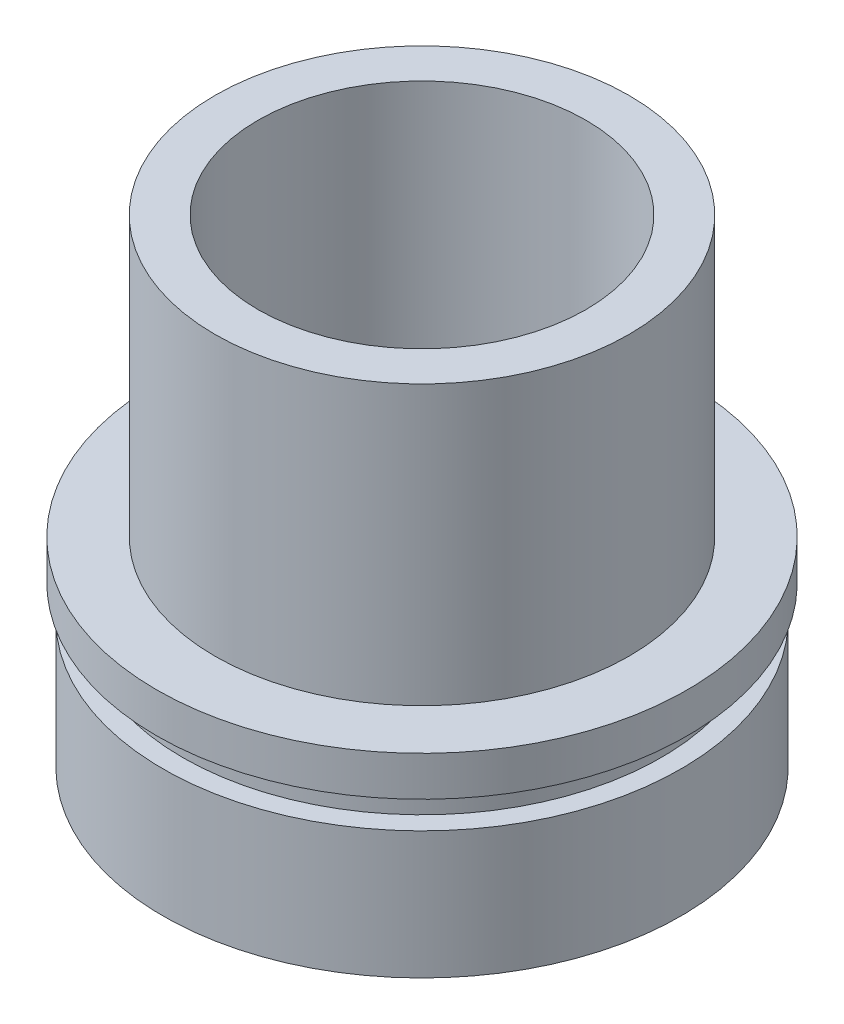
ISO-10303-21;
HEADER;
FILE_DESCRIPTION(('STEP AP214'),'2;1');
FILE_NAME('part.step','',(''),(''),'','','');
FILE_SCHEMA(('AUTOMOTIVE_DESIGN { 1 0 10303 214 1 1 1 1 }'));
ENDSEC;
DATA;
#1=APPLICATION_CONTEXT('core data for automotive mechanical design processes');
#2=APPLICATION_PROTOCOL_DEFINITION('international standard','automotive_design',2000,#1);
#3=PRODUCT_CONTEXT('',#1,'mechanical');
#4=PRODUCT('Part','Part','',(#3));
#5=PRODUCT_RELATED_PRODUCT_CATEGORY('part','',(#4));
#6=PRODUCT_DEFINITION_FORMATION('','',#4);
#7=PRODUCT_DEFINITION_CONTEXT('part definition',#1,'design');
#8=PRODUCT_DEFINITION('design','',#6,#7);
#9=PRODUCT_DEFINITION_SHAPE('','',#8);
#10=(LENGTH_UNIT() NAMED_UNIT(*) SI_UNIT(.MILLI.,.METRE.));
#11=(NAMED_UNIT(*) PLANE_ANGLE_UNIT() SI_UNIT($,.RADIAN.));
#12=(NAMED_UNIT(*) SI_UNIT($,.STERADIAN.) SOLID_ANGLE_UNIT());
#13=UNCERTAINTY_MEASURE_WITH_UNIT(LENGTH_MEASURE(1.E-05),#10,'distance_accuracy_value','');
#14=(GEOMETRIC_REPRESENTATION_CONTEXT(3) GLOBAL_UNCERTAINTY_ASSIGNED_CONTEXT((#13)) GLOBAL_UNIT_ASSIGNED_CONTEXT((#10,
#11,#12)) REPRESENTATION_CONTEXT('',''));
#15=CARTESIAN_POINT('',(0.,0.,0.));
#16=DIRECTION('',(0.,0.,1.));
#17=DIRECTION('',(1.,0.,0.));
#18=AXIS2_PLACEMENT_3D('',#15,#16,#17);
#19=CARTESIAN_POINT('',(0.,0.,0.));
#20=DIRECTION('',(0.,-1.,0.));
#21=DIRECTION('',(0.,0.,-1.));
#22=AXIS2_PLACEMENT_3D('',#19,#20,#21);
#23=CYLINDRICAL_SURFACE('',#22,10.3251);
#24=CARTESIAN_POINT('',(0.,5.08,0.));
#25=DIRECTION('',(0.,-1.,0.));
#26=DIRECTION('',(0.,0.,-1.));
#27=AXIS2_PLACEMENT_3D('',#24,#25,#26);
#28=CIRCLE('',#27,10.3251);
#29=CARTESIAN_POINT('',(0.,5.08,-10.3251));
#30=VERTEX_POINT('',#29);
#31=EDGE_CURVE('E37',#30,#30,#28,.T.);
#32=ORIENTED_EDGE('',*,*,#31,.T.);
#33=EDGE_LOOP('',(#32));
#34=FACE_BOUND('',#33,.T.);
#35=CARTESIAN_POINT('',(0.,0.,0.));
#36=DIRECTION('',(0.,-1.,0.));
#37=DIRECTION('',(0.,0.,-1.));
#38=AXIS2_PLACEMENT_3D('',#35,#36,#37);
#39=CIRCLE('',#38,10.3251);
#40=CARTESIAN_POINT('',(0.,0.,-10.3251));
#41=VERTEX_POINT('',#40);
#42=EDGE_CURVE('E10',#41,#41,#39,.T.);
#43=ORIENTED_EDGE('',*,*,#42,.F.);
#44=EDGE_LOOP('',(#43));
#45=FACE_BOUND('',#44,.T.);
#46=ADVANCED_FACE('F34',(#34,#45),#23,.T.);
#47=CARTESIAN_POINT('',(-6.5405,0.,0.));
#48=DIRECTION('',(0.,1.,0.));
#49=DIRECTION('',(0.,0.,1.));
#50=AXIS2_PLACEMENT_3D('',#47,#48,#49);
#51=PLANE('',#50);
#52=CARTESIAN_POINT('',(0.,0.,0.));
#53=DIRECTION('',(0.,-1.,0.));
#54=DIRECTION('',(0.,0.,-1.));
#55=AXIS2_PLACEMENT_3D('',#52,#53,#54);
#56=CIRCLE('',#55,6.5405);
#57=CARTESIAN_POINT('',(0.,0.,-6.5405));
#58=VERTEX_POINT('',#57);
#59=EDGE_CURVE('E41',#58,#58,#56,.T.);
#60=ORIENTED_EDGE('',*,*,#59,.F.);
#61=EDGE_LOOP('',(#60));
#62=FACE_BOUND('',#61,.T.);
#63=ORIENTED_EDGE('',*,*,#42,.T.);
#64=EDGE_LOOP('',(#63));
#65=FACE_BOUND('',#64,.T.);
#66=ADVANCED_FACE('F86',(#62,#65),#51,.F.);
#67=CARTESIAN_POINT('',(0.,0.,0.));
#68=DIRECTION('',(0.,-1.,0.));
#69=DIRECTION('',(0.,0.,-1.));
#70=AXIS2_PLACEMENT_3D('',#67,#68,#69);
#71=CYLINDRICAL_SURFACE('',#70,6.5405);
#72=CARTESIAN_POINT('',(0.,19.05,0.));
#73=DIRECTION('',(0.,-1.,0.));
#74=DIRECTION('',(0.,0.,-1.));
#75=AXIS2_PLACEMENT_3D('',#72,#73,#74);
#76=CIRCLE('',#75,6.5405);
#77=CARTESIAN_POINT('',(0.,19.05,-6.5405));
#78=VERTEX_POINT('',#77);
#79=EDGE_CURVE('E45',#78,#78,#76,.T.);
#80=ORIENTED_EDGE('',*,*,#79,.F.);
#81=EDGE_LOOP('',(#80));
#82=FACE_BOUND('',#81,.T.);
#83=ORIENTED_EDGE('',*,*,#59,.T.);
#84=EDGE_LOOP('',(#83));
#85=FACE_BOUND('',#84,.T.);
#86=ADVANCED_FACE('F90',(#82,#85),#71,.F.);
#87=CARTESIAN_POINT('',(-6.5405,19.05,0.));
#88=DIRECTION('',(0.,-1.,0.));
#89=DIRECTION('',(0.,0.,-1.));
#90=AXIS2_PLACEMENT_3D('',#87,#88,#89);
#91=PLANE('',#90);
#92=CARTESIAN_POINT('',(0.,19.05,0.));
#93=DIRECTION('',(0.,-1.,0.));
#94=DIRECTION('',(0.,0.,-1.));
#95=AXIS2_PLACEMENT_3D('',#92,#93,#94);
#96=CIRCLE('',#95,8.255);
#97=CARTESIAN_POINT('',(0.,19.05,-8.255));
#98=VERTEX_POINT('',#97);
#99=EDGE_CURVE('E50',#98,#98,#96,.T.);
#100=ORIENTED_EDGE('',*,*,#99,.F.);
#101=EDGE_LOOP('',(#100));
#102=FACE_BOUND('',#101,.T.);
#103=ORIENTED_EDGE('',*,*,#79,.T.);
#104=EDGE_LOOP('',(#103));
#105=FACE_BOUND('',#104,.T.);
#106=ADVANCED_FACE('F95',(#102,#105),#91,.F.);
#107=CARTESIAN_POINT('',(0.,0.,0.));
#108=DIRECTION('',(0.,-1.,0.));
#109=DIRECTION('',(0.,0.,-1.));
#110=AXIS2_PLACEMENT_3D('',#107,#108,#109);
#111=CYLINDRICAL_SURFACE('',#110,8.255);
#112=CARTESIAN_POINT('',(0.,7.9375,0.));
#113=DIRECTION('',(0.,-1.,0.));
#114=DIRECTION('',(0.,0.,-1.));
#115=AXIS2_PLACEMENT_3D('',#112,#113,#114);
#116=CIRCLE('',#115,8.255);
#117=CARTESIAN_POINT('',(0.,7.9375,-8.255));
#118=VERTEX_POINT('',#117);
#119=EDGE_CURVE('E53',#118,#118,#116,.T.);
#120=ORIENTED_EDGE('',*,*,#119,.F.);
#121=EDGE_LOOP('',(#120));
#122=FACE_BOUND('',#121,.T.);
#123=ORIENTED_EDGE('',*,*,#99,.T.);
#124=EDGE_LOOP('',(#123));
#125=FACE_BOUND('',#124,.T.);
#126=ADVANCED_FACE('F102',(#122,#125),#111,.T.);
#127=CARTESIAN_POINT('',(-10.5791,7.9375,0.));
#128=DIRECTION('',(0.,-1.,0.));
#129=DIRECTION('',(0.,0.,-1.));
#130=AXIS2_PLACEMENT_3D('',#127,#128,#129);
#131=PLANE('',#130);
#132=CARTESIAN_POINT('',(0.,7.9375,0.));
#133=DIRECTION('',(0.,-1.,0.));
#134=DIRECTION('',(0.,0.,-1.));
#135=AXIS2_PLACEMENT_3D('',#132,#133,#134);
#136=CIRCLE('',#135,10.5791);
#137=CARTESIAN_POINT('',(0.,7.9375,-10.5791));
#138=VERTEX_POINT('',#137);
#139=EDGE_CURVE('E56',#138,#138,#136,.T.);
#140=ORIENTED_EDGE('',*,*,#139,.F.);
#141=EDGE_LOOP('',(#140));
#142=FACE_BOUND('',#141,.T.);
#143=ORIENTED_EDGE('',*,*,#119,.T.);
#144=EDGE_LOOP('',(#143));
#145=FACE_BOUND('',#144,.T.);
#146=ADVANCED_FACE('F106',(#142,#145),#131,.F.);
#147=CARTESIAN_POINT('',(0.,0.,0.));
#148=DIRECTION('',(0.,-1.,0.));
#149=DIRECTION('',(0.,0.,-1.));
#150=AXIS2_PLACEMENT_3D('',#147,#148,#149);
#151=CYLINDRICAL_SURFACE('',#150,10.5791);
#152=CARTESIAN_POINT('',(0.,6.35,0.));
#153=DIRECTION('',(0.,-1.,0.));
#154=DIRECTION('',(0.,0.,-1.));
#155=AXIS2_PLACEMENT_3D('',#152,#153,#154);
#156=CIRCLE('',#155,10.5791);
#157=CARTESIAN_POINT('',(0.,6.35,-10.5791));
#158=VERTEX_POINT('',#157);
#159=EDGE_CURVE('E59',#158,#158,#156,.T.);
#160=ORIENTED_EDGE('',*,*,#159,.F.);
#161=EDGE_LOOP('',(#160));
#162=FACE_BOUND('',#161,.T.);
#163=ORIENTED_EDGE('',*,*,#139,.T.);
#164=EDGE_LOOP('',(#163));
#165=FACE_BOUND('',#164,.T.);
#166=ADVANCED_FACE('F110',(#162,#165),#151,.T.);
#167=CARTESIAN_POINT('',(-10.3251,6.35,0.));
#168=DIRECTION('',(0.,1.,0.));
#169=DIRECTION('',(0.,0.,1.));
#170=AXIS2_PLACEMENT_3D('',#167,#168,#169);
#171=PLANE('',#170);
#172=ORIENTED_EDGE('',*,*,#159,.T.);
#173=EDGE_LOOP('',(#172));
#174=FACE_BOUND('',#173,.T.);
#175=CARTESIAN_POINT('',(0.,6.35,0.));
#176=DIRECTION('',(0.,1.,0.));
#177=DIRECTION('',(0.,0.,1.));
#178=AXIS2_PLACEMENT_3D('',#175,#176,#177);
#179=CIRCLE('',#178,9.54024);
#180=CARTESIAN_POINT('',(0.,6.35,9.54024));
#181=VERTEX_POINT('',#180);
#182=EDGE_CURVE('E65',#181,#181,#179,.T.);
#183=ORIENTED_EDGE('',*,*,#182,.T.);
#184=EDGE_LOOP('',(#183));
#185=FACE_BOUND('',#184,.T.);
#186=ADVANCED_FACE('F69',(#174,#185),#171,.F.);
#187=CARTESIAN_POINT('',(-11.4466190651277,5.08,0.));
#188=DIRECTION('',(0.,-1.,0.));
#189=DIRECTION('',(0.,0.,-1.));
#190=AXIS2_PLACEMENT_3D('',#187,#188,#189);
#191=PLANE('',#190);
#192=CARTESIAN_POINT('',(0.,5.08,0.));
#193=DIRECTION('',(0.,1.,0.));
#194=DIRECTION('',(0.,0.,1.));
#195=AXIS2_PLACEMENT_3D('',#192,#193,#194);
#196=CIRCLE('',#195,9.54024);
#197=CARTESIAN_POINT('',(0.,5.08,9.54024));
#198=VERTEX_POINT('',#197);
#199=EDGE_CURVE('E62',#198,#198,#196,.T.);
#200=ORIENTED_EDGE('',*,*,#199,.F.);
#201=EDGE_LOOP('',(#200));
#202=FACE_BOUND('',#201,.T.);
#203=ORIENTED_EDGE('',*,*,#31,.F.);
#204=EDGE_LOOP('',(#203));
#205=FACE_BOUND('',#204,.T.);
#206=ADVANCED_FACE('F74',(#202,#205),#191,.F.);
#207=CARTESIAN_POINT('',(0.,0.,0.));
#208=DIRECTION('',(0.,1.,0.));
#209=DIRECTION('',(0.,0.,1.));
#210=AXIS2_PLACEMENT_3D('',#207,#208,#209);
#211=CYLINDRICAL_SURFACE('',#210,9.54024);
#212=ORIENTED_EDGE('',*,*,#182,.F.);
#213=EDGE_LOOP('',(#212));
#214=FACE_BOUND('',#213,.T.);
#215=ORIENTED_EDGE('',*,*,#199,.T.);
#216=EDGE_LOOP('',(#215));
#217=FACE_BOUND('',#216,.T.);
#218=ADVANCED_FACE('F71',(#214,#217),#211,.T.);
#219=CLOSED_SHELL('',(#46,#66,#86,#106,#126,#146,#166,#186,#206,#218));
#220=MANIFOLD_SOLID_BREP('B2',#219);
#221=ADVANCED_BREP_SHAPE_REPRESENTATION('',(#18,#220),#14);
#222=SHAPE_DEFINITION_REPRESENTATION(#9,#221);
ENDSEC;
END-ISO-10303-21;
